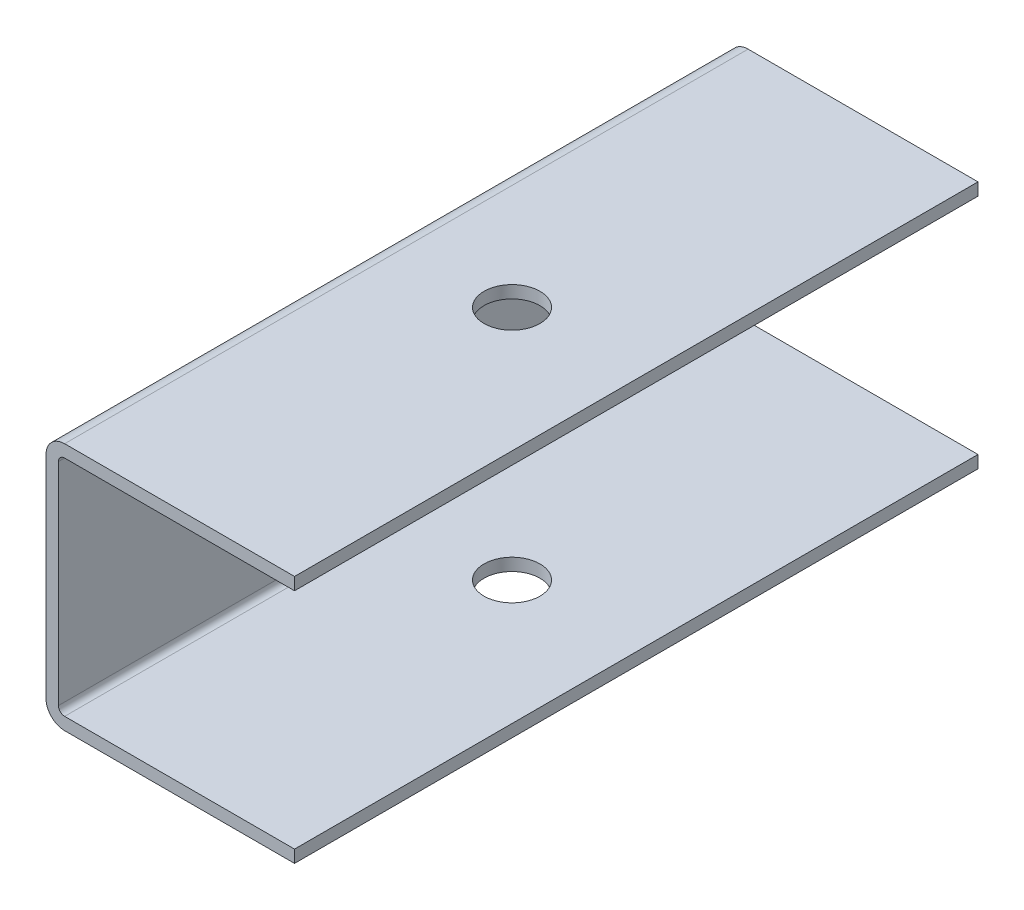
from build123d import *

# Parameters (mm, degrees)
BASE_EXTRUSION_DEPTH    = 110
ESQUISSE2_R             = 4.5
ENL_V_MAT_EXTRU_1_DEPTH = 124.693168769


with BuildPart() as part:
    # Esquisse1 → Base-Extrusion (new body)
    with BuildSketch(Plane.XY):
        with BuildLine():
            Line((2, -3), (2, -37))
            ThreePointArc((2, -37), (2.292893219, -37.707106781), (3, -38))
            Line((3, -38), (40, -38))
            Line((40, -38), (40, -40))
            Line((40, -40), (3, -40))
            ThreePointArc((3, -40), (0.878679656, -39.121320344), (0, -37))
            Line((0, -37), (0, -3))
            ThreePointArc((0, -3), (0.878679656, -0.878679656), (3, 0))
            Line((3, 0), (40, 0))
            Line((40, 0), (40, -2))
            Line((40, -2), (3, -2))
            ThreePointArc((3, -2), (2.292893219, -2.292893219), (2, -3))
        make_face()
    extrude(amount=BASE_EXTRUSION_DEPTH)

    # Esquisse2 → Enl_v. mat.-Extru.1 (cut, through all)
    with BuildSketch(Plane(origin=(0, 0, 0), x_dir=(-1, 0, 0), z_dir=(0, 1, 0))):
        with Locations(Location((-20, 55, 0), (0, 0, 90))):
            Circle(ESQUISSE2_R)
    extrude(amount=-ENL_V_MAT_EXTRU_1_DEPTH, mode=Mode.SUBTRACT)


solid = part.part
